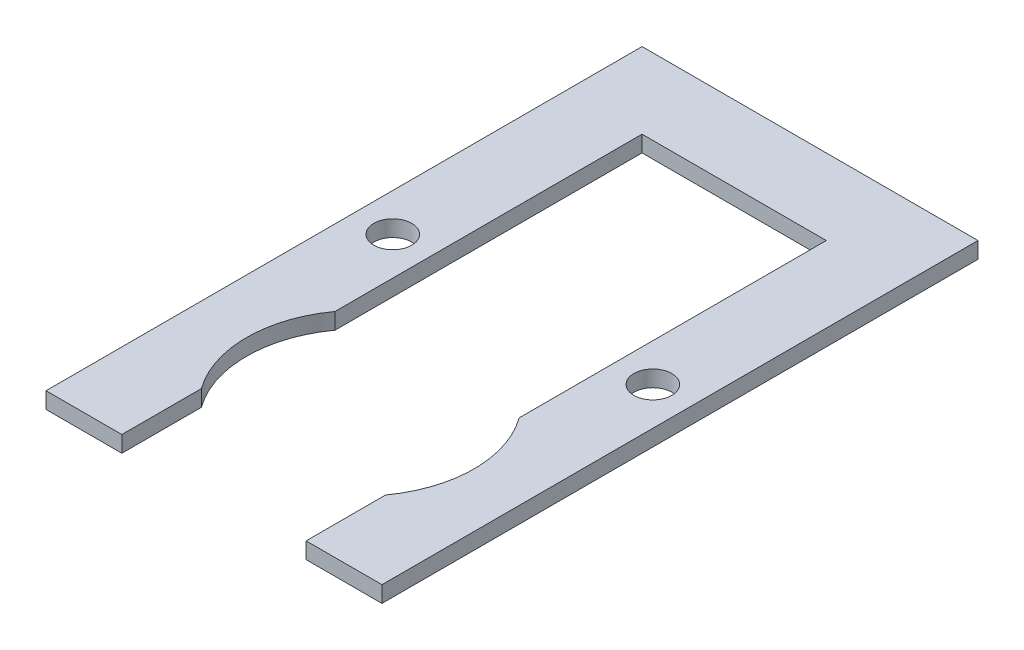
ISO-10303-21;
HEADER;
FILE_DESCRIPTION(('STEP AP214'),'2;1');
FILE_NAME('part.step','',(''),(''),'','','');
FILE_SCHEMA(('AUTOMOTIVE_DESIGN { 1 0 10303 214 1 1 1 1 }'));
ENDSEC;
DATA;
#1=APPLICATION_CONTEXT('core data for automotive mechanical design processes');
#2=APPLICATION_PROTOCOL_DEFINITION('international standard','automotive_design',2000,#1);
#3=PRODUCT_CONTEXT('',#1,'mechanical');
#4=PRODUCT('Part','Part','',(#3));
#5=PRODUCT_RELATED_PRODUCT_CATEGORY('part','',(#4));
#6=PRODUCT_DEFINITION_FORMATION('','',#4);
#7=PRODUCT_DEFINITION_CONTEXT('part definition',#1,'design');
#8=PRODUCT_DEFINITION('design','',#6,#7);
#9=PRODUCT_DEFINITION_SHAPE('','',#8);
#10=(LENGTH_UNIT() NAMED_UNIT(*) SI_UNIT(.MILLI.,.METRE.));
#11=(NAMED_UNIT(*) PLANE_ANGLE_UNIT() SI_UNIT($,.RADIAN.));
#12=(NAMED_UNIT(*) SI_UNIT($,.STERADIAN.) SOLID_ANGLE_UNIT());
#13=UNCERTAINTY_MEASURE_WITH_UNIT(LENGTH_MEASURE(1.E-05),#10,'distance_accuracy_value','');
#14=(GEOMETRIC_REPRESENTATION_CONTEXT(3) GLOBAL_UNCERTAINTY_ASSIGNED_CONTEXT((#13)) GLOBAL_UNIT_ASSIGNED_CONTEXT((#10,
#11,#12)) REPRESENTATION_CONTEXT('',''));
#15=CARTESIAN_POINT('',(0.,0.,0.));
#16=DIRECTION('',(0.,0.,1.));
#17=DIRECTION('',(1.,0.,0.));
#18=AXIS2_PLACEMENT_3D('',#15,#16,#17);
#19=CARTESIAN_POINT('',(31.,3.,-27.));
#20=DIRECTION('',(0.,1.,0.));
#21=DIRECTION('',(0.,0.,1.));
#22=AXIS2_PLACEMENT_3D('',#19,#20,#21);
#23=PLANE('',#22);
#24=CARTESIAN_POINT('',(7.,3.,-57.));
#25=DIRECTION('',(0.,1.,0.));
#26=DIRECTION('',(0.,0.,1.));
#27=AXIS2_PLACEMENT_3D('',#24,#25,#26);
#28=CIRCLE('',#27,3.5);
#29=CARTESIAN_POINT('',(7.,3.,-53.5));
#30=VERTEX_POINT('',#29);
#31=EDGE_CURVE('E138',#30,#30,#28,.T.);
#32=ORIENTED_EDGE('',*,*,#31,.F.);
#33=EDGE_LOOP('',(#32));
#34=FACE_BOUND('',#33,.T.);
#35=DIRECTION('',(0.,0.,1.));
#36=VECTOR('',#35,1.);
#37=CARTESIAN_POINT('',(0.,3.,0.));
#38=LINE('',#37,#36);
#39=CARTESIAN_POINT('',(0.,3.,-110.));
#40=VERTEX_POINT('',#39);
#41=CARTESIAN_POINT('',(0.,3.,0.));
#42=VERTEX_POINT('',#41);
#43=EDGE_CURVE('E164',#40,#42,#38,.T.);
#44=ORIENTED_EDGE('',*,*,#43,.T.);
#45=DIRECTION('',(1.,0.,0.));
#46=VECTOR('',#45,1.);
#47=CARTESIAN_POINT('',(0.,3.,0.));
#48=LINE('',#47,#46);
#49=CARTESIAN_POINT('',(14.,3.,0.));
#50=VERTEX_POINT('',#49);
#51=EDGE_CURVE('E133',#42,#50,#48,.T.);
#52=ORIENTED_EDGE('',*,*,#51,.T.);
#53=DIRECTION('',(0.,0.,-1.));
#54=VECTOR('',#53,1.);
#55=CARTESIAN_POINT('',(14.,3.,0.));
#56=LINE('',#55,#54);
#57=CARTESIAN_POINT('',(14.,3.,-14.671171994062));
#58=VERTEX_POINT('',#57);
#59=EDGE_CURVE('E167',#50,#58,#56,.T.);
#60=ORIENTED_EDGE('',*,*,#59,.T.);
#61=CARTESIAN_POINT('',(31.,3.,-27.));
#62=DIRECTION('',(0.,-1.,0.));
#63=DIRECTION('',(0.,0.,1.));
#64=AXIS2_PLACEMENT_3D('',#61,#62,#63);
#65=CIRCLE('',#64,21.);
#66=CARTESIAN_POINT('',(14.,3.,-39.328828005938));
#67=VERTEX_POINT('',#66);
#68=EDGE_CURVE('E169',#58,#67,#65,.T.);
#69=ORIENTED_EDGE('',*,*,#68,.T.);
#70=DIRECTION('',(0.,0.,-1.));
#71=VECTOR('',#70,1.);
#72=CARTESIAN_POINT('',(14.,3.,-39.328828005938));
#73=LINE('',#72,#71);
#74=CARTESIAN_POINT('',(14.,3.,-96.));
#75=VERTEX_POINT('',#74);
#76=EDGE_CURVE('E171',#67,#75,#73,.T.);
#77=ORIENTED_EDGE('',*,*,#76,.T.);
#78=DIRECTION('',(1.,0.,0.));
#79=VECTOR('',#78,1.);
#80=CARTESIAN_POINT('',(14.,3.,-96.));
#81=LINE('',#80,#79);
#82=CARTESIAN_POINT('',(48.,3.,-96.));
#83=VERTEX_POINT('',#82);
#84=EDGE_CURVE('E173',#75,#83,#81,.T.);
#85=ORIENTED_EDGE('',*,*,#84,.T.);
#86=DIRECTION('',(0.,0.,1.));
#87=VECTOR('',#86,1.);
#88=CARTESIAN_POINT('',(48.,3.,-39.328828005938));
#89=LINE('',#88,#87);
#90=CARTESIAN_POINT('',(48.,3.,-39.328828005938));
#91=VERTEX_POINT('',#90);
#92=EDGE_CURVE('E175',#83,#91,#89,.T.);
#93=ORIENTED_EDGE('',*,*,#92,.T.);
#94=CARTESIAN_POINT('',(31.,3.,-27.));
#95=DIRECTION('',(0.,-1.,0.));
#96=DIRECTION('',(0.,0.,1.));
#97=AXIS2_PLACEMENT_3D('',#94,#95,#96);
#98=CIRCLE('',#97,21.);
#99=CARTESIAN_POINT('',(48.,3.,-14.671171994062));
#100=VERTEX_POINT('',#99);
#101=EDGE_CURVE('E177',#91,#100,#98,.T.);
#102=ORIENTED_EDGE('',*,*,#101,.T.);
#103=DIRECTION('',(0.,0.,1.));
#104=VECTOR('',#103,1.);
#105=CARTESIAN_POINT('',(48.,3.,0.));
#106=LINE('',#105,#104);
#107=CARTESIAN_POINT('',(48.,3.,0.));
#108=VERTEX_POINT('',#107);
#109=EDGE_CURVE('E179',#100,#108,#106,.T.);
#110=ORIENTED_EDGE('',*,*,#109,.T.);
#111=DIRECTION('',(1.,0.,0.));
#112=VECTOR('',#111,1.);
#113=CARTESIAN_POINT('',(48.,3.,0.));
#114=LINE('',#113,#112);
#115=CARTESIAN_POINT('',(62.,3.,0.));
#116=VERTEX_POINT('',#115);
#117=EDGE_CURVE('E181',#108,#116,#114,.T.);
#118=ORIENTED_EDGE('',*,*,#117,.T.);
#119=DIRECTION('',(0.,0.,-1.));
#120=VECTOR('',#119,1.);
#121=CARTESIAN_POINT('',(62.,3.,0.));
#122=LINE('',#121,#120);
#123=CARTESIAN_POINT('',(62.,3.,-110.));
#124=VERTEX_POINT('',#123);
#125=EDGE_CURVE('E50',#116,#124,#122,.T.);
#126=ORIENTED_EDGE('',*,*,#125,.T.);
#127=DIRECTION('',(-1.,0.,0.));
#128=VECTOR('',#127,1.);
#129=CARTESIAN_POINT('',(0.,3.,-110.));
#130=LINE('',#129,#128);
#131=EDGE_CURVE('E45',#124,#40,#130,.T.);
#132=ORIENTED_EDGE('',*,*,#131,.T.);
#133=EDGE_LOOP('',(#44,#52,#60,#69,#77,#85,#93,#102,#110,#118,#126,#132));
#134=FACE_BOUND('',#133,.T.);
#135=CARTESIAN_POINT('',(55.,3.,-57.));
#136=DIRECTION('',(0.,1.,0.));
#137=DIRECTION('',(0.,0.,1.));
#138=AXIS2_PLACEMENT_3D('',#135,#136,#137);
#139=CIRCLE('',#138,3.5);
#140=CARTESIAN_POINT('',(55.,3.,-53.5));
#141=VERTEX_POINT('',#140);
#142=EDGE_CURVE('E284',#141,#141,#139,.T.);
#143=ORIENTED_EDGE('',*,*,#142,.F.);
#144=EDGE_LOOP('',(#143));
#145=FACE_BOUND('',#144,.T.);
#146=ADVANCED_FACE('F30',(#34,#134,#145),#23,.T.);
#147=CARTESIAN_POINT('',(31.,0.,-27.));
#148=DIRECTION('',(0.,1.,0.));
#149=DIRECTION('',(0.,0.,1.));
#150=AXIS2_PLACEMENT_3D('',#147,#148,#149);
#151=PLANE('',#150);
#152=CARTESIAN_POINT('',(7.,0.,-57.));
#153=DIRECTION('',(0.,1.,0.));
#154=DIRECTION('',(0.,0.,1.));
#155=AXIS2_PLACEMENT_3D('',#152,#153,#154);
#156=CIRCLE('',#155,3.5);
#157=CARTESIAN_POINT('',(7.,0.,-53.5));
#158=VERTEX_POINT('',#157);
#159=EDGE_CURVE('E141',#158,#158,#156,.T.);
#160=ORIENTED_EDGE('',*,*,#159,.T.);
#161=EDGE_LOOP('',(#160));
#162=FACE_BOUND('',#161,.T.);
#163=DIRECTION('',(0.,0.,1.));
#164=VECTOR('',#163,1.);
#165=CARTESIAN_POINT('',(0.,0.,0.));
#166=LINE('',#165,#164);
#167=CARTESIAN_POINT('',(0.,0.,-110.));
#168=VERTEX_POINT('',#167);
#169=CARTESIAN_POINT('',(0.,0.,0.));
#170=VERTEX_POINT('',#169);
#171=EDGE_CURVE('E124',#168,#170,#166,.T.);
#172=ORIENTED_EDGE('',*,*,#171,.F.);
#173=DIRECTION('',(-1.,0.,0.));
#174=VECTOR('',#173,1.);
#175=CARTESIAN_POINT('',(0.,0.,-110.));
#176=LINE('',#175,#174);
#177=CARTESIAN_POINT('',(62.,0.,-110.));
#178=VERTEX_POINT('',#177);
#179=EDGE_CURVE('E162',#178,#168,#176,.T.);
#180=ORIENTED_EDGE('',*,*,#179,.F.);
#181=DIRECTION('',(0.,0.,-1.));
#182=VECTOR('',#181,1.);
#183=CARTESIAN_POINT('',(62.,0.,0.));
#184=LINE('',#183,#182);
#185=CARTESIAN_POINT('',(62.,0.,0.));
#186=VERTEX_POINT('',#185);
#187=EDGE_CURVE('E160',#186,#178,#184,.T.);
#188=ORIENTED_EDGE('',*,*,#187,.F.);
#189=DIRECTION('',(1.,0.,0.));
#190=VECTOR('',#189,1.);
#191=CARTESIAN_POINT('',(48.,0.,0.));
#192=LINE('',#191,#190);
#193=CARTESIAN_POINT('',(48.,0.,0.));
#194=VERTEX_POINT('',#193);
#195=EDGE_CURVE('E158',#194,#186,#192,.T.);
#196=ORIENTED_EDGE('',*,*,#195,.F.);
#197=DIRECTION('',(0.,0.,1.));
#198=VECTOR('',#197,1.);
#199=CARTESIAN_POINT('',(48.,0.,0.));
#200=LINE('',#199,#198);
#201=CARTESIAN_POINT('',(48.,0.,-14.671171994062));
#202=VERTEX_POINT('',#201);
#203=EDGE_CURVE('E156',#202,#194,#200,.T.);
#204=ORIENTED_EDGE('',*,*,#203,.F.);
#205=CARTESIAN_POINT('',(31.,0.,-27.));
#206=DIRECTION('',(0.,-1.,0.));
#207=DIRECTION('',(0.,0.,1.));
#208=AXIS2_PLACEMENT_3D('',#205,#206,#207);
#209=CIRCLE('',#208,21.);
#210=CARTESIAN_POINT('',(48.,0.,-39.328828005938));
#211=VERTEX_POINT('',#210);
#212=EDGE_CURVE('E154',#211,#202,#209,.T.);
#213=ORIENTED_EDGE('',*,*,#212,.F.);
#214=DIRECTION('',(0.,0.,1.));
#215=VECTOR('',#214,1.);
#216=CARTESIAN_POINT('',(48.,0.,-39.328828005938));
#217=LINE('',#216,#215);
#218=CARTESIAN_POINT('',(48.,0.,-96.));
#219=VERTEX_POINT('',#218);
#220=EDGE_CURVE('E152',#219,#211,#217,.T.);
#221=ORIENTED_EDGE('',*,*,#220,.F.);
#222=DIRECTION('',(1.,0.,0.));
#223=VECTOR('',#222,1.);
#224=CARTESIAN_POINT('',(14.,0.,-96.));
#225=LINE('',#224,#223);
#226=CARTESIAN_POINT('',(14.,0.,-96.));
#227=VERTEX_POINT('',#226);
#228=EDGE_CURVE('E150',#227,#219,#225,.T.);
#229=ORIENTED_EDGE('',*,*,#228,.F.);
#230=DIRECTION('',(0.,0.,-1.));
#231=VECTOR('',#230,1.);
#232=CARTESIAN_POINT('',(14.,0.,-39.328828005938));
#233=LINE('',#232,#231);
#234=CARTESIAN_POINT('',(14.,0.,-39.328828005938));
#235=VERTEX_POINT('',#234);
#236=EDGE_CURVE('E148',#235,#227,#233,.T.);
#237=ORIENTED_EDGE('',*,*,#236,.F.);
#238=CARTESIAN_POINT('',(31.,0.,-27.));
#239=DIRECTION('',(0.,-1.,0.));
#240=DIRECTION('',(0.,0.,1.));
#241=AXIS2_PLACEMENT_3D('',#238,#239,#240);
#242=CIRCLE('',#241,21.);
#243=CARTESIAN_POINT('',(14.,0.,-14.671171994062));
#244=VERTEX_POINT('',#243);
#245=EDGE_CURVE('E146',#244,#235,#242,.T.);
#246=ORIENTED_EDGE('',*,*,#245,.F.);
#247=DIRECTION('',(0.,0.,-1.));
#248=VECTOR('',#247,1.);
#249=CARTESIAN_POINT('',(14.,0.,0.));
#250=LINE('',#249,#248);
#251=CARTESIAN_POINT('',(14.,0.,0.));
#252=VERTEX_POINT('',#251);
#253=EDGE_CURVE('E126',#252,#244,#250,.T.);
#254=ORIENTED_EDGE('',*,*,#253,.F.);
#255=DIRECTION('',(1.,0.,0.));
#256=VECTOR('',#255,1.);
#257=CARTESIAN_POINT('',(0.,0.,0.));
#258=LINE('',#257,#256);
#259=EDGE_CURVE('E119',#170,#252,#258,.T.);
#260=ORIENTED_EDGE('',*,*,#259,.F.);
#261=EDGE_LOOP('',(#172,#180,#188,#196,#204,#213,#221,#229,#237,#246,#254,#260));
#262=FACE_BOUND('',#261,.T.);
#263=CARTESIAN_POINT('',(55.,0.,-57.));
#264=DIRECTION('',(0.,1.,0.));
#265=DIRECTION('',(0.,0.,1.));
#266=AXIS2_PLACEMENT_3D('',#263,#264,#265);
#267=CIRCLE('',#266,3.5);
#268=CARTESIAN_POINT('',(55.,0.,-53.5));
#269=VERTEX_POINT('',#268);
#270=EDGE_CURVE('E287',#269,#269,#267,.T.);
#271=ORIENTED_EDGE('',*,*,#270,.T.);
#272=EDGE_LOOP('',(#271));
#273=FACE_BOUND('',#272,.T.);
#274=ADVANCED_FACE('F120',(#162,#262,#273),#151,.F.);
#275=CARTESIAN_POINT('',(0.,3.,0.));
#276=DIRECTION('',(1.,0.,0.));
#277=DIRECTION('',(0.,0.,-1.));
#278=AXIS2_PLACEMENT_3D('',#275,#276,#277);
#279=PLANE('',#278);
#280=ORIENTED_EDGE('',*,*,#171,.T.);
#281=DIRECTION('',(0.,-1.,0.));
#282=VECTOR('',#281,1.);
#283=CARTESIAN_POINT('',(0.,3.,0.));
#284=LINE('',#283,#282);
#285=EDGE_CURVE('E11',#42,#170,#284,.T.);
#286=ORIENTED_EDGE('',*,*,#285,.F.);
#287=ORIENTED_EDGE('',*,*,#43,.F.);
#288=DIRECTION('',(0.,-1.,0.));
#289=VECTOR('',#288,1.);
#290=CARTESIAN_POINT('',(0.,3.,-110.));
#291=LINE('',#290,#289);
#292=EDGE_CURVE('E137',#40,#168,#291,.T.);
#293=ORIENTED_EDGE('',*,*,#292,.T.);
#294=EDGE_LOOP('',(#280,#286,#287,#293));
#295=FACE_BOUND('',#294,.T.);
#296=ADVANCED_FACE('F32',(#295),#279,.F.);
#297=CARTESIAN_POINT('',(0.,3.,0.));
#298=DIRECTION('',(0.,0.,-1.));
#299=DIRECTION('',(-1.,0.,0.));
#300=AXIS2_PLACEMENT_3D('',#297,#298,#299);
#301=PLANE('',#300);
#302=ORIENTED_EDGE('',*,*,#259,.T.);
#303=DIRECTION('',(0.,-1.,0.));
#304=VECTOR('',#303,1.);
#305=CARTESIAN_POINT('',(14.,3.,0.));
#306=LINE('',#305,#304);
#307=EDGE_CURVE('E38',#50,#252,#306,.T.);
#308=ORIENTED_EDGE('',*,*,#307,.F.);
#309=ORIENTED_EDGE('',*,*,#51,.F.);
#310=ORIENTED_EDGE('',*,*,#285,.T.);
#311=EDGE_LOOP('',(#302,#308,#309,#310));
#312=FACE_BOUND('',#311,.T.);
#313=ADVANCED_FACE('F132',(#312),#301,.F.);
#314=CARTESIAN_POINT('',(14.,3.,0.));
#315=DIRECTION('',(-1.,0.,0.));
#316=DIRECTION('',(0.,0.,1.));
#317=AXIS2_PLACEMENT_3D('',#314,#315,#316);
#318=PLANE('',#317);
#319=ORIENTED_EDGE('',*,*,#253,.T.);
#320=DIRECTION('',(0.,-1.,0.));
#321=VECTOR('',#320,1.);
#322=CARTESIAN_POINT('',(14.,3.,-14.671171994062));
#323=LINE('',#322,#321);
#324=EDGE_CURVE('E210',#58,#244,#323,.T.);
#325=ORIENTED_EDGE('',*,*,#324,.F.);
#326=ORIENTED_EDGE('',*,*,#59,.F.);
#327=ORIENTED_EDGE('',*,*,#307,.T.);
#328=EDGE_LOOP('',(#319,#325,#326,#327));
#329=FACE_BOUND('',#328,.T.);
#330=ADVANCED_FACE('F214',(#329),#318,.F.);
#331=CARTESIAN_POINT('',(31.,3.,-27.));
#332=DIRECTION('',(0.,-1.,0.));
#333=DIRECTION('',(0.,0.,-1.));
#334=AXIS2_PLACEMENT_3D('',#331,#332,#333);
#335=CYLINDRICAL_SURFACE('',#334,21.);
#336=ORIENTED_EDGE('',*,*,#245,.T.);
#337=DIRECTION('',(0.,-1.,0.));
#338=VECTOR('',#337,1.);
#339=CARTESIAN_POINT('',(14.,3.,-39.328828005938));
#340=LINE('',#339,#338);
#341=EDGE_CURVE('E207',#67,#235,#340,.T.);
#342=ORIENTED_EDGE('',*,*,#341,.F.);
#343=ORIENTED_EDGE('',*,*,#68,.F.);
#344=ORIENTED_EDGE('',*,*,#324,.T.);
#345=EDGE_LOOP('',(#336,#342,#343,#344));
#346=FACE_BOUND('',#345,.T.);
#347=ADVANCED_FACE('F222',(#346),#335,.F.);
#348=CARTESIAN_POINT('',(14.,3.,-39.328828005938));
#349=DIRECTION('',(-1.,0.,0.));
#350=DIRECTION('',(0.,0.,1.));
#351=AXIS2_PLACEMENT_3D('',#348,#349,#350);
#352=PLANE('',#351);
#353=ORIENTED_EDGE('',*,*,#236,.T.);
#354=DIRECTION('',(0.,-1.,0.));
#355=VECTOR('',#354,1.);
#356=CARTESIAN_POINT('',(14.,3.,-96.));
#357=LINE('',#356,#355);
#358=EDGE_CURVE('E204',#75,#227,#357,.T.);
#359=ORIENTED_EDGE('',*,*,#358,.F.);
#360=ORIENTED_EDGE('',*,*,#76,.F.);
#361=ORIENTED_EDGE('',*,*,#341,.T.);
#362=EDGE_LOOP('',(#353,#359,#360,#361));
#363=FACE_BOUND('',#362,.T.);
#364=ADVANCED_FACE('F225',(#363),#352,.F.);
#365=CARTESIAN_POINT('',(14.,3.,-96.));
#366=DIRECTION('',(0.,0.,-1.));
#367=DIRECTION('',(-1.,0.,0.));
#368=AXIS2_PLACEMENT_3D('',#365,#366,#367);
#369=PLANE('',#368);
#370=ORIENTED_EDGE('',*,*,#228,.T.);
#371=DIRECTION('',(0.,-1.,0.));
#372=VECTOR('',#371,1.);
#373=CARTESIAN_POINT('',(48.,3.,-96.));
#374=LINE('',#373,#372);
#375=EDGE_CURVE('E201',#83,#219,#374,.T.);
#376=ORIENTED_EDGE('',*,*,#375,.F.);
#377=ORIENTED_EDGE('',*,*,#84,.F.);
#378=ORIENTED_EDGE('',*,*,#358,.T.);
#379=EDGE_LOOP('',(#370,#376,#377,#378));
#380=FACE_BOUND('',#379,.T.);
#381=ADVANCED_FACE('F230',(#380),#369,.F.);
#382=CARTESIAN_POINT('',(48.,3.,-39.328828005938));
#383=DIRECTION('',(1.,0.,0.));
#384=DIRECTION('',(0.,0.,-1.));
#385=AXIS2_PLACEMENT_3D('',#382,#383,#384);
#386=PLANE('',#385);
#387=ORIENTED_EDGE('',*,*,#220,.T.);
#388=DIRECTION('',(0.,-1.,0.));
#389=VECTOR('',#388,1.);
#390=CARTESIAN_POINT('',(48.,3.,-39.328828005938));
#391=LINE('',#390,#389);
#392=EDGE_CURVE('E198',#91,#211,#391,.T.);
#393=ORIENTED_EDGE('',*,*,#392,.F.);
#394=ORIENTED_EDGE('',*,*,#92,.F.);
#395=ORIENTED_EDGE('',*,*,#375,.T.);
#396=EDGE_LOOP('',(#387,#393,#394,#395));
#397=FACE_BOUND('',#396,.T.);
#398=ADVANCED_FACE('F236',(#397),#386,.F.);
#399=CARTESIAN_POINT('',(31.,3.,-27.));
#400=DIRECTION('',(0.,-1.,0.));
#401=DIRECTION('',(0.,0.,-1.));
#402=AXIS2_PLACEMENT_3D('',#399,#400,#401);
#403=CYLINDRICAL_SURFACE('',#402,21.);
#404=ORIENTED_EDGE('',*,*,#212,.T.);
#405=DIRECTION('',(0.,-1.,0.));
#406=VECTOR('',#405,1.);
#407=CARTESIAN_POINT('',(48.,3.,-14.671171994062));
#408=LINE('',#407,#406);
#409=EDGE_CURVE('E195',#100,#202,#408,.T.);
#410=ORIENTED_EDGE('',*,*,#409,.F.);
#411=ORIENTED_EDGE('',*,*,#101,.F.);
#412=ORIENTED_EDGE('',*,*,#392,.T.);
#413=EDGE_LOOP('',(#404,#410,#411,#412));
#414=FACE_BOUND('',#413,.T.);
#415=ADVANCED_FACE('F240',(#414),#403,.F.);
#416=CARTESIAN_POINT('',(48.,3.,0.));
#417=DIRECTION('',(1.,0.,0.));
#418=DIRECTION('',(0.,0.,-1.));
#419=AXIS2_PLACEMENT_3D('',#416,#417,#418);
#420=PLANE('',#419);
#421=ORIENTED_EDGE('',*,*,#203,.T.);
#422=DIRECTION('',(0.,-1.,0.));
#423=VECTOR('',#422,1.);
#424=CARTESIAN_POINT('',(48.,3.,0.));
#425=LINE('',#424,#423);
#426=EDGE_CURVE('E192',#108,#194,#425,.T.);
#427=ORIENTED_EDGE('',*,*,#426,.F.);
#428=ORIENTED_EDGE('',*,*,#109,.F.);
#429=ORIENTED_EDGE('',*,*,#409,.T.);
#430=EDGE_LOOP('',(#421,#427,#428,#429));
#431=FACE_BOUND('',#430,.T.);
#432=ADVANCED_FACE('F245',(#431),#420,.F.);
#433=CARTESIAN_POINT('',(48.,3.,0.));
#434=DIRECTION('',(0.,0.,-1.));
#435=DIRECTION('',(-1.,0.,0.));
#436=AXIS2_PLACEMENT_3D('',#433,#434,#435);
#437=PLANE('',#436);
#438=ORIENTED_EDGE('',*,*,#195,.T.);
#439=DIRECTION('',(0.,-1.,0.));
#440=VECTOR('',#439,1.);
#441=CARTESIAN_POINT('',(62.,3.,0.));
#442=LINE('',#441,#440);
#443=EDGE_CURVE('E189',#116,#186,#442,.T.);
#444=ORIENTED_EDGE('',*,*,#443,.F.);
#445=ORIENTED_EDGE('',*,*,#117,.F.);
#446=ORIENTED_EDGE('',*,*,#426,.T.);
#447=EDGE_LOOP('',(#438,#444,#445,#446));
#448=FACE_BOUND('',#447,.T.);
#449=ADVANCED_FACE('F249',(#448),#437,.F.);
#450=CARTESIAN_POINT('',(62.,3.,0.));
#451=DIRECTION('',(-1.,0.,0.));
#452=DIRECTION('',(0.,0.,1.));
#453=AXIS2_PLACEMENT_3D('',#450,#451,#452);
#454=PLANE('',#453);
#455=ORIENTED_EDGE('',*,*,#187,.T.);
#456=DIRECTION('',(0.,-1.,0.));
#457=VECTOR('',#456,1.);
#458=CARTESIAN_POINT('',(62.,3.,-110.));
#459=LINE('',#458,#457);
#460=EDGE_CURVE('E186',#124,#178,#459,.T.);
#461=ORIENTED_EDGE('',*,*,#460,.F.);
#462=ORIENTED_EDGE('',*,*,#125,.F.);
#463=ORIENTED_EDGE('',*,*,#443,.T.);
#464=EDGE_LOOP('',(#455,#461,#462,#463));
#465=FACE_BOUND('',#464,.T.);
#466=ADVANCED_FACE('F253',(#465),#454,.F.);
#467=CARTESIAN_POINT('',(0.,3.,-110.));
#468=DIRECTION('',(0.,0.,1.));
#469=DIRECTION('',(1.,0.,0.));
#470=AXIS2_PLACEMENT_3D('',#467,#468,#469);
#471=PLANE('',#470);
#472=ORIENTED_EDGE('',*,*,#179,.T.);
#473=ORIENTED_EDGE('',*,*,#292,.F.);
#474=ORIENTED_EDGE('',*,*,#131,.F.);
#475=ORIENTED_EDGE('',*,*,#460,.T.);
#476=EDGE_LOOP('',(#472,#473,#474,#475));
#477=FACE_BOUND('',#476,.T.);
#478=ADVANCED_FACE('F255',(#477),#471,.F.);
#479=CARTESIAN_POINT('',(7.,3.,-57.));
#480=DIRECTION('',(0.,-1.,0.));
#481=DIRECTION('',(0.,0.,-1.));
#482=AXIS2_PLACEMENT_3D('',#479,#480,#481);
#483=CYLINDRICAL_SURFACE('',#482,3.5);
#484=ORIENTED_EDGE('',*,*,#31,.T.);
#485=EDGE_LOOP('',(#484));
#486=FACE_BOUND('',#485,.T.);
#487=ORIENTED_EDGE('',*,*,#159,.F.);
#488=EDGE_LOOP('',(#487));
#489=FACE_BOUND('',#488,.T.);
#490=ADVANCED_FACE('F257',(#486,#489),#483,.F.);
#491=CARTESIAN_POINT('',(55.,3.,-57.));
#492=DIRECTION('',(0.,-1.,0.));
#493=DIRECTION('',(0.,0.,-1.));
#494=AXIS2_PLACEMENT_3D('',#491,#492,#493);
#495=CYLINDRICAL_SURFACE('',#494,3.5);
#496=ORIENTED_EDGE('',*,*,#142,.T.);
#497=EDGE_LOOP('',(#496));
#498=FACE_BOUND('',#497,.T.);
#499=ORIENTED_EDGE('',*,*,#270,.F.);
#500=EDGE_LOOP('',(#499));
#501=FACE_BOUND('',#500,.T.);
#502=ADVANCED_FACE('F263',(#498,#501),#495,.F.);
#503=CLOSED_SHELL('',(#146,#274,#296,#313,#330,#347,#364,#381,#398,#415,#432,#449,#466,#478,
#490,#502));
#504=MANIFOLD_SOLID_BREP('B2',#503);
#505=ADVANCED_BREP_SHAPE_REPRESENTATION('',(#18,#504),#14);
#506=SHAPE_DEFINITION_REPRESENTATION(#9,#505);
ENDSEC;
END-ISO-10303-21;
